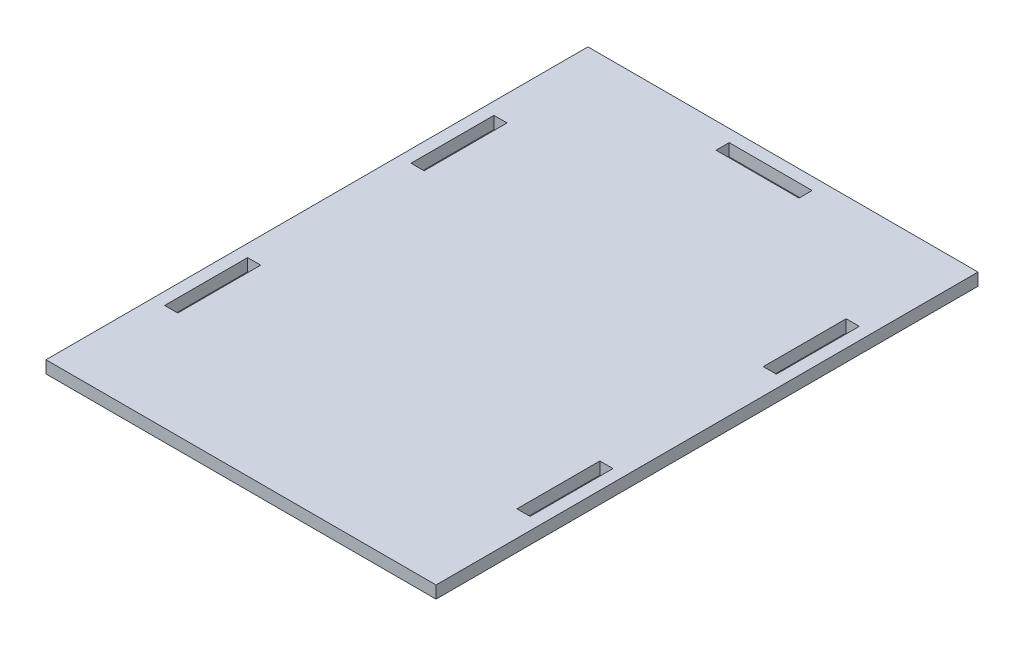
ISO-10303-21;
HEADER;
FILE_DESCRIPTION(('STEP AP214'),'2;1');
FILE_NAME('part.step','',(''),(''),'','','');
FILE_SCHEMA(('AUTOMOTIVE_DESIGN { 1 0 10303 214 1 1 1 1 }'));
ENDSEC;
DATA;
#1=APPLICATION_CONTEXT('core data for automotive mechanical design processes');
#2=APPLICATION_PROTOCOL_DEFINITION('international standard','automotive_design',2000,#1);
#3=PRODUCT_CONTEXT('',#1,'mechanical');
#4=PRODUCT('Part','Part','',(#3));
#5=PRODUCT_RELATED_PRODUCT_CATEGORY('part','',(#4));
#6=PRODUCT_DEFINITION_FORMATION('','',#4);
#7=PRODUCT_DEFINITION_CONTEXT('part definition',#1,'design');
#8=PRODUCT_DEFINITION('design','',#6,#7);
#9=PRODUCT_DEFINITION_SHAPE('','',#8);
#10=(LENGTH_UNIT() NAMED_UNIT(*) SI_UNIT(.MILLI.,.METRE.));
#11=(NAMED_UNIT(*) PLANE_ANGLE_UNIT() SI_UNIT($,.RADIAN.));
#12=(NAMED_UNIT(*) SI_UNIT($,.STERADIAN.) SOLID_ANGLE_UNIT());
#13=UNCERTAINTY_MEASURE_WITH_UNIT(LENGTH_MEASURE(1.E-05),#10,'distance_accuracy_value','');
#14=(GEOMETRIC_REPRESENTATION_CONTEXT(3) GLOBAL_UNCERTAINTY_ASSIGNED_CONTEXT((#13)) GLOBAL_UNIT_ASSIGNED_CONTEXT((#10,
#11,#12)) REPRESENTATION_CONTEXT('',''));
#15=CARTESIAN_POINT('',(0.,0.,0.));
#16=DIRECTION('',(0.,0.,1.));
#17=DIRECTION('',(1.,0.,0.));
#18=AXIS2_PLACEMENT_3D('',#15,#16,#17);
#19=CARTESIAN_POINT('',(0.,15.,0.));
#20=DIRECTION('',(0.,1.,0.));
#21=DIRECTION('',(0.,0.,1.));
#22=AXIS2_PLACEMENT_3D('',#19,#20,#21);
#23=PLANE('',#22);
#24=DIRECTION('',(0.,0.,1.));
#25=VECTOR('',#24,1.);
#26=CARTESIAN_POINT('',(-222.5,15.,99.4999999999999));
#27=LINE('',#26,#25);
#28=CARTESIAN_POINT('',(-222.5,15.,99.4999999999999));
#29=VERTEX_POINT('',#28);
#30=CARTESIAN_POINT('',(-222.5,15.,200.5));
#31=VERTEX_POINT('',#30);
#32=EDGE_CURVE('E50',#29,#31,#27,.T.);
#33=ORIENTED_EDGE('',*,*,#32,.F.);
#34=DIRECTION('',(-1.,0.,0.));
#35=VECTOR('',#34,1.);
#36=CARTESIAN_POINT('',(-222.5,15.,99.4999999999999));
#37=LINE('',#36,#35);
#38=CARTESIAN_POINT('',(-206.5,15.,99.4999999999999));
#39=VERTEX_POINT('',#38);
#40=EDGE_CURVE('E215',#39,#29,#37,.T.);
#41=ORIENTED_EDGE('',*,*,#40,.F.);
#42=DIRECTION('',(0.,0.,-1.));
#43=VECTOR('',#42,1.);
#44=CARTESIAN_POINT('',(-206.5,15.,99.4999999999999));
#45=LINE('',#44,#43);
#46=CARTESIAN_POINT('',(-206.5,15.,200.5));
#47=VERTEX_POINT('',#46);
#48=EDGE_CURVE('E218',#47,#39,#45,.T.);
#49=ORIENTED_EDGE('',*,*,#48,.F.);
#50=DIRECTION('',(1.,0.,0.));
#51=VECTOR('',#50,1.);
#52=CARTESIAN_POINT('',(-222.5,15.,200.5));
#53=LINE('',#52,#51);
#54=EDGE_CURVE('E224',#31,#47,#53,.T.);
#55=ORIENTED_EDGE('',*,*,#54,.F.);
#56=EDGE_LOOP('',(#33,#41,#49,#55));
#57=FACE_BOUND('',#56,.T.);
#58=DIRECTION('',(0.,0.,1.));
#59=VECTOR('',#58,1.);
#60=CARTESIAN_POINT('',(-50.5,15.,-315.));
#61=LINE('',#60,#59);
#62=CARTESIAN_POINT('',(-50.5,15.,-315.));
#63=VERTEX_POINT('',#62);
#64=CARTESIAN_POINT('',(-50.5,15.,-299.));
#65=VERTEX_POINT('',#64);
#66=EDGE_CURVE('E58',#63,#65,#61,.T.);
#67=ORIENTED_EDGE('',*,*,#66,.F.);
#68=DIRECTION('',(-1.,0.,0.));
#69=VECTOR('',#68,1.);
#70=CARTESIAN_POINT('',(-50.5,15.,-315.));
#71=LINE('',#70,#69);
#72=CARTESIAN_POINT('',(50.5,15.,-315.));
#73=VERTEX_POINT('',#72);
#74=EDGE_CURVE('E239',#73,#63,#71,.T.);
#75=ORIENTED_EDGE('',*,*,#74,.F.);
#76=DIRECTION('',(0.,0.,-1.));
#77=VECTOR('',#76,1.);
#78=CARTESIAN_POINT('',(50.5,15.,-315.));
#79=LINE('',#78,#77);
#80=CARTESIAN_POINT('',(50.5,15.,-299.));
#81=VERTEX_POINT('',#80);
#82=EDGE_CURVE('E254',#81,#73,#79,.T.);
#83=ORIENTED_EDGE('',*,*,#82,.F.);
#84=DIRECTION('',(1.,0.,0.));
#85=VECTOR('',#84,1.);
#86=CARTESIAN_POINT('',(-50.5,15.,-299.));
#87=LINE('',#86,#85);
#88=EDGE_CURVE('E250',#65,#81,#87,.T.);
#89=ORIENTED_EDGE('',*,*,#88,.F.);
#90=EDGE_LOOP('',(#67,#75,#83,#89));
#91=FACE_BOUND('',#90,.T.);
#92=DIRECTION('',(-1.,0.,0.));
#93=VECTOR('',#92,1.);
#94=CARTESIAN_POINT('',(222.5,15.,99.4999999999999));
#95=LINE('',#94,#93);
#96=CARTESIAN_POINT('',(222.5,15.,99.4999999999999));
#97=VERTEX_POINT('',#96);
#98=CARTESIAN_POINT('',(206.5,15.,99.4999999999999));
#99=VERTEX_POINT('',#98);
#100=EDGE_CURVE('E279',#97,#99,#95,.T.);
#101=ORIENTED_EDGE('',*,*,#100,.F.);
#102=DIRECTION('',(0.,0.,-1.));
#103=VECTOR('',#102,1.);
#104=CARTESIAN_POINT('',(222.5,15.,99.4999999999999));
#105=LINE('',#104,#103);
#106=CARTESIAN_POINT('',(222.5,15.,200.5));
#107=VERTEX_POINT('',#106);
#108=EDGE_CURVE('E269',#107,#97,#105,.T.);
#109=ORIENTED_EDGE('',*,*,#108,.F.);
#110=DIRECTION('',(1.,0.,0.));
#111=VECTOR('',#110,1.);
#112=CARTESIAN_POINT('',(222.5,15.,200.5));
#113=LINE('',#112,#111);
#114=CARTESIAN_POINT('',(206.5,15.,200.5));
#115=VERTEX_POINT('',#114);
#116=EDGE_CURVE('E285',#115,#107,#113,.T.);
#117=ORIENTED_EDGE('',*,*,#116,.F.);
#118=DIRECTION('',(0.,0.,1.));
#119=VECTOR('',#118,1.);
#120=CARTESIAN_POINT('',(206.5,15.,99.4999999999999));
#121=LINE('',#120,#119);
#122=EDGE_CURVE('E281',#99,#115,#121,.T.);
#123=ORIENTED_EDGE('',*,*,#122,.F.);
#124=EDGE_LOOP('',(#101,#109,#117,#123));
#125=FACE_BOUND('',#124,.T.);
#126=DIRECTION('',(-1.,0.,0.));
#127=VECTOR('',#126,1.);
#128=CARTESIAN_POINT('',(222.5,15.,-200.5));
#129=LINE('',#128,#127);
#130=CARTESIAN_POINT('',(222.5,15.,-200.5));
#131=VERTEX_POINT('',#130);
#132=CARTESIAN_POINT('',(206.5,15.,-200.5));
#133=VERTEX_POINT('',#132);
#134=EDGE_CURVE('E311',#131,#133,#129,.T.);
#135=ORIENTED_EDGE('',*,*,#134,.F.);
#136=DIRECTION('',(0.,0.,-1.));
#137=VECTOR('',#136,1.);
#138=CARTESIAN_POINT('',(222.5,15.,-200.5));
#139=LINE('',#138,#137);
#140=CARTESIAN_POINT('',(222.5,15.,-99.5));
#141=VERTEX_POINT('',#140);
#142=EDGE_CURVE('E301',#141,#131,#139,.T.);
#143=ORIENTED_EDGE('',*,*,#142,.F.);
#144=DIRECTION('',(1.,0.,0.));
#145=VECTOR('',#144,1.);
#146=CARTESIAN_POINT('',(222.5,15.,-99.5));
#147=LINE('',#146,#145);
#148=CARTESIAN_POINT('',(206.5,15.,-99.5));
#149=VERTEX_POINT('',#148);
#150=EDGE_CURVE('E316',#149,#141,#147,.T.);
#151=ORIENTED_EDGE('',*,*,#150,.F.);
#152=DIRECTION('',(0.,0.,1.));
#153=VECTOR('',#152,1.);
#154=CARTESIAN_POINT('',(206.5,15.,-200.5));
#155=LINE('',#154,#153);
#156=EDGE_CURVE('E313',#133,#149,#155,.T.);
#157=ORIENTED_EDGE('',*,*,#156,.F.);
#158=EDGE_LOOP('',(#135,#143,#151,#157));
#159=FACE_BOUND('',#158,.T.);
#160=DIRECTION('',(0.,0.,1.));
#161=VECTOR('',#160,1.);
#162=CARTESIAN_POINT('',(-222.5,15.,-200.5));
#163=LINE('',#162,#161);
#164=CARTESIAN_POINT('',(-222.5,15.,-200.5));
#165=VERTEX_POINT('',#164);
#166=CARTESIAN_POINT('',(-222.5,15.,-99.5));
#167=VERTEX_POINT('',#166);
#168=EDGE_CURVE('E231',#165,#167,#163,.T.);
#169=ORIENTED_EDGE('',*,*,#168,.F.);
#170=DIRECTION('',(-1.,0.,0.));
#171=VECTOR('',#170,1.);
#172=CARTESIAN_POINT('',(-222.5,15.,-200.5));
#173=LINE('',#172,#171);
#174=CARTESIAN_POINT('',(-206.5,15.,-200.5));
#175=VERTEX_POINT('',#174);
#176=EDGE_CURVE('E332',#175,#165,#173,.T.);
#177=ORIENTED_EDGE('',*,*,#176,.F.);
#178=DIRECTION('',(0.,0.,-1.));
#179=VECTOR('',#178,1.);
#180=CARTESIAN_POINT('',(-206.5,15.,-200.5));
#181=LINE('',#180,#179);
#182=CARTESIAN_POINT('',(-206.5,15.,-99.5));
#183=VERTEX_POINT('',#182);
#184=EDGE_CURVE('E346',#183,#175,#181,.T.);
#185=ORIENTED_EDGE('',*,*,#184,.F.);
#186=DIRECTION('',(1.,0.,0.));
#187=VECTOR('',#186,1.);
#188=CARTESIAN_POINT('',(-222.5,15.,-99.5));
#189=LINE('',#188,#187);
#190=EDGE_CURVE('E343',#167,#183,#189,.T.);
#191=ORIENTED_EDGE('',*,*,#190,.F.);
#192=EDGE_LOOP('',(#169,#177,#185,#191));
#193=FACE_BOUND('',#192,.T.);
#194=DIRECTION('',(0.,0.,-1.));
#195=VECTOR('',#194,1.);
#196=CARTESIAN_POINT('',(237.5,15.,-330.));
#197=LINE('',#196,#195);
#198=CARTESIAN_POINT('',(237.5,15.,330.));
#199=VERTEX_POINT('',#198);
#200=CARTESIAN_POINT('',(237.5,15.,-330.));
#201=VERTEX_POINT('',#200);
#202=EDGE_CURVE('E353',#199,#201,#197,.T.);
#203=ORIENTED_EDGE('',*,*,#202,.T.);
#204=DIRECTION('',(-1.,0.,0.));
#205=VECTOR('',#204,1.);
#206=CARTESIAN_POINT('',(-237.5,15.,-330.));
#207=LINE('',#206,#205);
#208=CARTESIAN_POINT('',(-237.5,15.,-330.));
#209=VERTEX_POINT('',#208);
#210=EDGE_CURVE('E375',#201,#209,#207,.T.);
#211=ORIENTED_EDGE('',*,*,#210,.T.);
#212=DIRECTION('',(0.,0.,1.));
#213=VECTOR('',#212,1.);
#214=CARTESIAN_POINT('',(-237.5,15.,-330.));
#215=LINE('',#214,#213);
#216=CARTESIAN_POINT('',(-237.5,15.,330.));
#217=VERTEX_POINT('',#216);
#218=EDGE_CURVE('E378',#209,#217,#215,.T.);
#219=ORIENTED_EDGE('',*,*,#218,.T.);
#220=DIRECTION('',(1.,0.,0.));
#221=VECTOR('',#220,1.);
#222=CARTESIAN_POINT('',(-237.5,15.,330.));
#223=LINE('',#222,#221);
#224=EDGE_CURVE('E364',#217,#199,#223,.T.);
#225=ORIENTED_EDGE('',*,*,#224,.T.);
#226=EDGE_LOOP('',(#203,#211,#219,#225));
#227=FACE_BOUND('',#226,.T.);
#228=ADVANCED_FACE('F33',(#57,#91,#125,#159,#193,#227),#23,.T.);
#229=CARTESIAN_POINT('',(237.5,0.,-330.));
#230=DIRECTION('',(1.,0.,0.));
#231=DIRECTION('',(0.,0.,-1.));
#232=AXIS2_PLACEMENT_3D('',#229,#230,#231);
#233=PLANE('',#232);
#234=ORIENTED_EDGE('',*,*,#202,.F.);
#235=DIRECTION('',(0.,1.,0.));
#236=VECTOR('',#235,1.);
#237=CARTESIAN_POINT('',(237.5,0.,330.));
#238=LINE('',#237,#236);
#239=CARTESIAN_POINT('',(237.5,0.,330.));
#240=VERTEX_POINT('',#239);
#241=EDGE_CURVE('E11',#240,#199,#238,.T.);
#242=ORIENTED_EDGE('',*,*,#241,.F.);
#243=DIRECTION('',(0.,0.,-1.));
#244=VECTOR('',#243,1.);
#245=CARTESIAN_POINT('',(237.5,0.,-330.));
#246=LINE('',#245,#244);
#247=CARTESIAN_POINT('',(237.5,0.,-330.));
#248=VERTEX_POINT('',#247);
#249=EDGE_CURVE('E360',#240,#248,#246,.T.);
#250=ORIENTED_EDGE('',*,*,#249,.T.);
#251=DIRECTION('',(0.,1.,0.));
#252=VECTOR('',#251,1.);
#253=CARTESIAN_POINT('',(237.5,0.,-330.));
#254=LINE('',#253,#252);
#255=EDGE_CURVE('E37',#248,#201,#254,.T.);
#256=ORIENTED_EDGE('',*,*,#255,.T.);
#257=EDGE_LOOP('',(#234,#242,#250,#256));
#258=FACE_BOUND('',#257,.T.);
#259=ADVANCED_FACE('F389',(#258),#233,.T.);
#260=CARTESIAN_POINT('',(-237.5,0.,330.));
#261=DIRECTION('',(0.,0.,1.));
#262=DIRECTION('',(1.,0.,0.));
#263=AXIS2_PLACEMENT_3D('',#260,#261,#262);
#264=PLANE('',#263);
#265=ORIENTED_EDGE('',*,*,#224,.F.);
#266=DIRECTION('',(0.,1.,0.));
#267=VECTOR('',#266,1.);
#268=CARTESIAN_POINT('',(-237.5,0.,330.));
#269=LINE('',#268,#267);
#270=CARTESIAN_POINT('',(-237.5,0.,330.));
#271=VERTEX_POINT('',#270);
#272=EDGE_CURVE('E42',#271,#217,#269,.T.);
#273=ORIENTED_EDGE('',*,*,#272,.F.);
#274=DIRECTION('',(1.,0.,0.));
#275=VECTOR('',#274,1.);
#276=CARTESIAN_POINT('',(-237.5,0.,330.));
#277=LINE('',#276,#275);
#278=EDGE_CURVE('E370',#271,#240,#277,.T.);
#279=ORIENTED_EDGE('',*,*,#278,.T.);
#280=ORIENTED_EDGE('',*,*,#241,.T.);
#281=EDGE_LOOP('',(#265,#273,#279,#280));
#282=FACE_BOUND('',#281,.T.);
#283=ADVANCED_FACE('F396',(#282),#264,.T.);
#284=CARTESIAN_POINT('',(-237.5,0.,-330.));
#285=DIRECTION('',(-1.,0.,0.));
#286=DIRECTION('',(0.,0.,1.));
#287=AXIS2_PLACEMENT_3D('',#284,#285,#286);
#288=PLANE('',#287);
#289=ORIENTED_EDGE('',*,*,#218,.F.);
#290=DIRECTION('',(0.,1.,0.));
#291=VECTOR('',#290,1.);
#292=CARTESIAN_POINT('',(-237.5,0.,-330.));
#293=LINE('',#292,#291);
#294=CARTESIAN_POINT('',(-237.5,0.,-330.));
#295=VERTEX_POINT('',#294);
#296=EDGE_CURVE('E383',#295,#209,#293,.T.);
#297=ORIENTED_EDGE('',*,*,#296,.F.);
#298=DIRECTION('',(0.,0.,1.));
#299=VECTOR('',#298,1.);
#300=CARTESIAN_POINT('',(-237.5,0.,-330.));
#301=LINE('',#300,#299);
#302=EDGE_CURVE('E367',#295,#271,#301,.T.);
#303=ORIENTED_EDGE('',*,*,#302,.T.);
#304=ORIENTED_EDGE('',*,*,#272,.T.);
#305=EDGE_LOOP('',(#289,#297,#303,#304));
#306=FACE_BOUND('',#305,.T.);
#307=ADVANCED_FACE('F401',(#306),#288,.T.);
#308=CARTESIAN_POINT('',(-237.5,0.,-330.));
#309=DIRECTION('',(0.,0.,-1.));
#310=DIRECTION('',(-1.,0.,0.));
#311=AXIS2_PLACEMENT_3D('',#308,#309,#310);
#312=PLANE('',#311);
#313=ORIENTED_EDGE('',*,*,#210,.F.);
#314=ORIENTED_EDGE('',*,*,#255,.F.);
#315=DIRECTION('',(-1.,0.,0.));
#316=VECTOR('',#315,1.);
#317=CARTESIAN_POINT('',(-237.5,0.,-330.));
#318=LINE('',#317,#316);
#319=EDGE_CURVE('E363',#248,#295,#318,.T.);
#320=ORIENTED_EDGE('',*,*,#319,.T.);
#321=ORIENTED_EDGE('',*,*,#296,.T.);
#322=EDGE_LOOP('',(#313,#314,#320,#321));
#323=FACE_BOUND('',#322,.T.);
#324=ADVANCED_FACE('F392',(#323),#312,.T.);
#325=CARTESIAN_POINT('',(0.,0.,0.));
#326=DIRECTION('',(0.,1.,0.));
#327=DIRECTION('',(0.,0.,1.));
#328=AXIS2_PLACEMENT_3D('',#325,#326,#327);
#329=PLANE('',#328);
#330=DIRECTION('',(-1.,0.,0.));
#331=VECTOR('',#330,1.);
#332=CARTESIAN_POINT('',(-222.5,0.,99.4999999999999));
#333=LINE('',#332,#331);
#334=CARTESIAN_POINT('',(-206.5,0.,99.4999999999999));
#335=VERTEX_POINT('',#334);
#336=CARTESIAN_POINT('',(-222.5,0.,99.4999999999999));
#337=VERTEX_POINT('',#336);
#338=EDGE_CURVE('E203',#335,#337,#333,.T.);
#339=ORIENTED_EDGE('',*,*,#338,.T.);
#340=DIRECTION('',(0.,0.,1.));
#341=VECTOR('',#340,1.);
#342=CARTESIAN_POINT('',(-222.5,0.,99.4999999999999));
#343=LINE('',#342,#341);
#344=CARTESIAN_POINT('',(-222.5,0.,200.5));
#345=VERTEX_POINT('',#344);
#346=EDGE_CURVE('E197',#337,#345,#343,.T.);
#347=ORIENTED_EDGE('',*,*,#346,.T.);
#348=DIRECTION('',(1.,0.,0.));
#349=VECTOR('',#348,1.);
#350=CARTESIAN_POINT('',(-222.5,0.,200.5));
#351=LINE('',#350,#349);
#352=CARTESIAN_POINT('',(-206.5,0.,200.5));
#353=VERTEX_POINT('',#352);
#354=EDGE_CURVE('E207',#345,#353,#351,.T.);
#355=ORIENTED_EDGE('',*,*,#354,.T.);
#356=DIRECTION('',(0.,0.,-1.));
#357=VECTOR('',#356,1.);
#358=CARTESIAN_POINT('',(-206.5,0.,99.4999999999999));
#359=LINE('',#358,#357);
#360=EDGE_CURVE('E211',#353,#335,#359,.T.);
#361=ORIENTED_EDGE('',*,*,#360,.T.);
#362=EDGE_LOOP('',(#339,#347,#355,#361));
#363=FACE_BOUND('',#362,.T.);
#364=DIRECTION('',(-1.,0.,0.));
#365=VECTOR('',#364,1.);
#366=CARTESIAN_POINT('',(-50.5,0.,-315.));
#367=LINE('',#366,#365);
#368=CARTESIAN_POINT('',(50.5,0.,-315.));
#369=VERTEX_POINT('',#368);
#370=CARTESIAN_POINT('',(-50.5,0.,-315.));
#371=VERTEX_POINT('',#370);
#372=EDGE_CURVE('E245',#369,#371,#367,.T.);
#373=ORIENTED_EDGE('',*,*,#372,.T.);
#374=DIRECTION('',(0.,0.,1.));
#375=VECTOR('',#374,1.);
#376=CARTESIAN_POINT('',(-50.5,0.,-315.));
#377=LINE('',#376,#375);
#378=CARTESIAN_POINT('',(-50.5,0.,-299.));
#379=VERTEX_POINT('',#378);
#380=EDGE_CURVE('E235',#371,#379,#377,.T.);
#381=ORIENTED_EDGE('',*,*,#380,.T.);
#382=DIRECTION('',(1.,0.,0.));
#383=VECTOR('',#382,1.);
#384=CARTESIAN_POINT('',(-50.5,0.,-299.));
#385=LINE('',#384,#383);
#386=CARTESIAN_POINT('',(50.5,0.,-299.));
#387=VERTEX_POINT('',#386);
#388=EDGE_CURVE('E238',#379,#387,#385,.T.);
#389=ORIENTED_EDGE('',*,*,#388,.T.);
#390=DIRECTION('',(0.,0.,-1.));
#391=VECTOR('',#390,1.);
#392=CARTESIAN_POINT('',(50.5,0.,-315.));
#393=LINE('',#392,#391);
#394=EDGE_CURVE('E242',#387,#369,#393,.T.);
#395=ORIENTED_EDGE('',*,*,#394,.T.);
#396=EDGE_LOOP('',(#373,#381,#389,#395));
#397=FACE_BOUND('',#396,.T.);
#398=DIRECTION('',(0.,0.,-1.));
#399=VECTOR('',#398,1.);
#400=CARTESIAN_POINT('',(222.5,0.,99.4999999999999));
#401=LINE('',#400,#399);
#402=CARTESIAN_POINT('',(222.5,0.,200.5));
#403=VERTEX_POINT('',#402);
#404=CARTESIAN_POINT('',(222.5,0.,99.4999999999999));
#405=VERTEX_POINT('',#404);
#406=EDGE_CURVE('E275',#403,#405,#401,.T.);
#407=ORIENTED_EDGE('',*,*,#406,.T.);
#408=DIRECTION('',(-1.,0.,0.));
#409=VECTOR('',#408,1.);
#410=CARTESIAN_POINT('',(222.5,0.,99.4999999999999));
#411=LINE('',#410,#409);
#412=CARTESIAN_POINT('',(206.5,0.,99.4999999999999));
#413=VERTEX_POINT('',#412);
#414=EDGE_CURVE('E265',#405,#413,#411,.T.);
#415=ORIENTED_EDGE('',*,*,#414,.T.);
#416=DIRECTION('',(0.,0.,1.));
#417=VECTOR('',#416,1.);
#418=CARTESIAN_POINT('',(206.5,0.,99.4999999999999));
#419=LINE('',#418,#417);
#420=CARTESIAN_POINT('',(206.5,0.,200.5));
#421=VERTEX_POINT('',#420);
#422=EDGE_CURVE('E268',#413,#421,#419,.T.);
#423=ORIENTED_EDGE('',*,*,#422,.T.);
#424=DIRECTION('',(1.,0.,0.));
#425=VECTOR('',#424,1.);
#426=CARTESIAN_POINT('',(222.5,0.,200.5));
#427=LINE('',#426,#425);
#428=EDGE_CURVE('E272',#421,#403,#427,.T.);
#429=ORIENTED_EDGE('',*,*,#428,.T.);
#430=EDGE_LOOP('',(#407,#415,#423,#429));
#431=FACE_BOUND('',#430,.T.);
#432=DIRECTION('',(0.,0.,-1.));
#433=VECTOR('',#432,1.);
#434=CARTESIAN_POINT('',(222.5,0.,-200.5));
#435=LINE('',#434,#433);
#436=CARTESIAN_POINT('',(222.5,0.,-99.5));
#437=VERTEX_POINT('',#436);
#438=CARTESIAN_POINT('',(222.5,0.,-200.5));
#439=VERTEX_POINT('',#438);
#440=EDGE_CURVE('E307',#437,#439,#435,.T.);
#441=ORIENTED_EDGE('',*,*,#440,.T.);
#442=DIRECTION('',(-1.,0.,0.));
#443=VECTOR('',#442,1.);
#444=CARTESIAN_POINT('',(222.5,0.,-200.5));
#445=LINE('',#444,#443);
#446=CARTESIAN_POINT('',(206.5,0.,-200.5));
#447=VERTEX_POINT('',#446);
#448=EDGE_CURVE('E297',#439,#447,#445,.T.);
#449=ORIENTED_EDGE('',*,*,#448,.T.);
#450=DIRECTION('',(0.,0.,1.));
#451=VECTOR('',#450,1.);
#452=CARTESIAN_POINT('',(206.5,0.,-200.5));
#453=LINE('',#452,#451);
#454=CARTESIAN_POINT('',(206.5,0.,-99.5));
#455=VERTEX_POINT('',#454);
#456=EDGE_CURVE('E300',#447,#455,#453,.T.);
#457=ORIENTED_EDGE('',*,*,#456,.T.);
#458=DIRECTION('',(1.,0.,0.));
#459=VECTOR('',#458,1.);
#460=CARTESIAN_POINT('',(222.5,0.,-99.5));
#461=LINE('',#460,#459);
#462=EDGE_CURVE('E304',#455,#437,#461,.T.);
#463=ORIENTED_EDGE('',*,*,#462,.T.);
#464=EDGE_LOOP('',(#441,#449,#457,#463));
#465=FACE_BOUND('',#464,.T.);
#466=DIRECTION('',(-1.,0.,0.));
#467=VECTOR('',#466,1.);
#468=CARTESIAN_POINT('',(-222.5,0.,-200.5));
#469=LINE('',#468,#467);
#470=CARTESIAN_POINT('',(-206.5,0.,-200.5));
#471=VERTEX_POINT('',#470);
#472=CARTESIAN_POINT('',(-222.5,0.,-200.5));
#473=VERTEX_POINT('',#472);
#474=EDGE_CURVE('E338',#471,#473,#469,.T.);
#475=ORIENTED_EDGE('',*,*,#474,.T.);
#476=DIRECTION('',(0.,0.,1.));
#477=VECTOR('',#476,1.);
#478=CARTESIAN_POINT('',(-222.5,0.,-200.5));
#479=LINE('',#478,#477);
#480=CARTESIAN_POINT('',(-222.5,0.,-99.5));
#481=VERTEX_POINT('',#480);
#482=EDGE_CURVE('E328',#473,#481,#479,.T.);
#483=ORIENTED_EDGE('',*,*,#482,.T.);
#484=DIRECTION('',(1.,0.,0.));
#485=VECTOR('',#484,1.);
#486=CARTESIAN_POINT('',(-222.5,0.,-99.5));
#487=LINE('',#486,#485);
#488=CARTESIAN_POINT('',(-206.5,0.,-99.5));
#489=VERTEX_POINT('',#488);
#490=EDGE_CURVE('E331',#481,#489,#487,.T.);
#491=ORIENTED_EDGE('',*,*,#490,.T.);
#492=DIRECTION('',(0.,0.,-1.));
#493=VECTOR('',#492,1.);
#494=CARTESIAN_POINT('',(-206.5,0.,-200.5));
#495=LINE('',#494,#493);
#496=EDGE_CURVE('E335',#489,#471,#495,.T.);
#497=ORIENTED_EDGE('',*,*,#496,.T.);
#498=EDGE_LOOP('',(#475,#483,#491,#497));
#499=FACE_BOUND('',#498,.T.);
#500=ORIENTED_EDGE('',*,*,#249,.F.);
#501=ORIENTED_EDGE('',*,*,#278,.F.);
#502=ORIENTED_EDGE('',*,*,#302,.F.);
#503=ORIENTED_EDGE('',*,*,#319,.F.);
#504=EDGE_LOOP('',(#500,#501,#502,#503));
#505=FACE_BOUND('',#504,.T.);
#506=ADVANCED_FACE('F35',(#363,#397,#431,#465,#499,#505),#329,.F.);
#507=CARTESIAN_POINT('',(-222.5,0.,-200.5));
#508=DIRECTION('',(-1.,0.,0.));
#509=DIRECTION('',(0.,0.,1.));
#510=AXIS2_PLACEMENT_3D('',#507,#508,#509);
#511=PLANE('',#510);
#512=ORIENTED_EDGE('',*,*,#168,.T.);
#513=DIRECTION('',(0.,1.,0.));
#514=VECTOR('',#513,1.);
#515=CARTESIAN_POINT('',(-222.5,0.,-99.5));
#516=LINE('',#515,#514);
#517=EDGE_CURVE('E341',#481,#167,#516,.T.);
#518=ORIENTED_EDGE('',*,*,#517,.F.);
#519=ORIENTED_EDGE('',*,*,#482,.F.);
#520=DIRECTION('',(0.,1.,0.));
#521=VECTOR('',#520,1.);
#522=CARTESIAN_POINT('',(-222.5,0.,-200.5));
#523=LINE('',#522,#521);
#524=EDGE_CURVE('E351',#473,#165,#523,.T.);
#525=ORIENTED_EDGE('',*,*,#524,.T.);
#526=EDGE_LOOP('',(#512,#518,#519,#525));
#527=FACE_BOUND('',#526,.T.);
#528=ADVANCED_FACE('F434',(#527),#511,.F.);
#529=CARTESIAN_POINT('',(-222.5,0.,-200.5));
#530=DIRECTION('',(0.,0.,-1.));
#531=DIRECTION('',(-1.,0.,0.));
#532=AXIS2_PLACEMENT_3D('',#529,#530,#531);
#533=PLANE('',#532);
#534=ORIENTED_EDGE('',*,*,#176,.T.);
#535=ORIENTED_EDGE('',*,*,#524,.F.);
#536=ORIENTED_EDGE('',*,*,#474,.F.);
#537=DIRECTION('',(0.,1.,0.));
#538=VECTOR('',#537,1.);
#539=CARTESIAN_POINT('',(-206.5,0.,-200.5));
#540=LINE('',#539,#538);
#541=EDGE_CURVE('E354',#471,#175,#540,.T.);
#542=ORIENTED_EDGE('',*,*,#541,.T.);
#543=EDGE_LOOP('',(#534,#535,#536,#542));
#544=FACE_BOUND('',#543,.T.);
#545=ADVANCED_FACE('F443',(#544),#533,.F.);
#546=CARTESIAN_POINT('',(-206.5,0.,-200.5));
#547=DIRECTION('',(1.,0.,0.));
#548=DIRECTION('',(0.,0.,-1.));
#549=AXIS2_PLACEMENT_3D('',#546,#547,#548);
#550=PLANE('',#549);
#551=ORIENTED_EDGE('',*,*,#184,.T.);
#552=ORIENTED_EDGE('',*,*,#541,.F.);
#553=ORIENTED_EDGE('',*,*,#496,.F.);
#554=DIRECTION('',(0.,1.,0.));
#555=VECTOR('',#554,1.);
#556=CARTESIAN_POINT('',(-206.5,0.,-99.5));
#557=LINE('',#556,#555);
#558=EDGE_CURVE('E356',#489,#183,#557,.T.);
#559=ORIENTED_EDGE('',*,*,#558,.T.);
#560=EDGE_LOOP('',(#551,#552,#553,#559));
#561=FACE_BOUND('',#560,.T.);
#562=ADVANCED_FACE('F445',(#561),#550,.F.);
#563=CARTESIAN_POINT('',(-222.5,0.,-99.5));
#564=DIRECTION('',(0.,0.,1.));
#565=DIRECTION('',(1.,0.,0.));
#566=AXIS2_PLACEMENT_3D('',#563,#564,#565);
#567=PLANE('',#566);
#568=ORIENTED_EDGE('',*,*,#190,.T.);
#569=ORIENTED_EDGE('',*,*,#558,.F.);
#570=ORIENTED_EDGE('',*,*,#490,.F.);
#571=ORIENTED_EDGE('',*,*,#517,.T.);
#572=EDGE_LOOP('',(#568,#569,#570,#571));
#573=FACE_BOUND('',#572,.T.);
#574=ADVANCED_FACE('F438',(#573),#567,.F.);
#575=CARTESIAN_POINT('',(222.5,0.,-200.5));
#576=DIRECTION('',(0.,0.,-1.));
#577=DIRECTION('',(-1.,0.,0.));
#578=AXIS2_PLACEMENT_3D('',#575,#576,#577);
#579=PLANE('',#578);
#580=ORIENTED_EDGE('',*,*,#134,.T.);
#581=DIRECTION('',(0.,1.,0.));
#582=VECTOR('',#581,1.);
#583=CARTESIAN_POINT('',(206.5,0.,-200.5));
#584=LINE('',#583,#582);
#585=EDGE_CURVE('E310',#447,#133,#584,.T.);
#586=ORIENTED_EDGE('',*,*,#585,.F.);
#587=ORIENTED_EDGE('',*,*,#448,.F.);
#588=DIRECTION('',(0.,1.,0.));
#589=VECTOR('',#588,1.);
#590=CARTESIAN_POINT('',(222.5,0.,-200.5));
#591=LINE('',#590,#589);
#592=EDGE_CURVE('E282',#439,#131,#591,.T.);
#593=ORIENTED_EDGE('',*,*,#592,.T.);
#594=EDGE_LOOP('',(#580,#586,#587,#593));
#595=FACE_BOUND('',#594,.T.);
#596=ADVANCED_FACE('F452',(#595),#579,.F.);
#597=CARTESIAN_POINT('',(222.5,0.,-200.5));
#598=DIRECTION('',(1.,0.,0.));
#599=DIRECTION('',(0.,0.,-1.));
#600=AXIS2_PLACEMENT_3D('',#597,#598,#599);
#601=PLANE('',#600);
#602=ORIENTED_EDGE('',*,*,#142,.T.);
#603=ORIENTED_EDGE('',*,*,#592,.F.);
#604=ORIENTED_EDGE('',*,*,#440,.F.);
#605=DIRECTION('',(0.,1.,0.));
#606=VECTOR('',#605,1.);
#607=CARTESIAN_POINT('',(222.5,0.,-99.5));
#608=LINE('',#607,#606);
#609=EDGE_CURVE('E322',#437,#141,#608,.T.);
#610=ORIENTED_EDGE('',*,*,#609,.T.);
#611=EDGE_LOOP('',(#602,#603,#604,#610));
#612=FACE_BOUND('',#611,.T.);
#613=ADVANCED_FACE('F523',(#612),#601,.F.);
#614=CARTESIAN_POINT('',(222.5,0.,-99.5));
#615=DIRECTION('',(0.,0.,1.));
#616=DIRECTION('',(1.,0.,0.));
#617=AXIS2_PLACEMENT_3D('',#614,#615,#616);
#618=PLANE('',#617);
#619=ORIENTED_EDGE('',*,*,#150,.T.);
#620=ORIENTED_EDGE('',*,*,#609,.F.);
#621=ORIENTED_EDGE('',*,*,#462,.F.);
#622=DIRECTION('',(0.,1.,0.));
#623=VECTOR('',#622,1.);
#624=CARTESIAN_POINT('',(206.5,0.,-99.5));
#625=LINE('',#624,#623);
#626=EDGE_CURVE('E324',#455,#149,#625,.T.);
#627=ORIENTED_EDGE('',*,*,#626,.T.);
#628=EDGE_LOOP('',(#619,#620,#621,#627));
#629=FACE_BOUND('',#628,.T.);
#630=ADVANCED_FACE('F531',(#629),#618,.F.);
#631=CARTESIAN_POINT('',(206.5,0.,-200.5));
#632=DIRECTION('',(-1.,0.,0.));
#633=DIRECTION('',(0.,0.,1.));
#634=AXIS2_PLACEMENT_3D('',#631,#632,#633);
#635=PLANE('',#634);
#636=ORIENTED_EDGE('',*,*,#156,.T.);
#637=ORIENTED_EDGE('',*,*,#626,.F.);
#638=ORIENTED_EDGE('',*,*,#456,.F.);
#639=ORIENTED_EDGE('',*,*,#585,.T.);
#640=EDGE_LOOP('',(#636,#637,#638,#639));
#641=FACE_BOUND('',#640,.T.);
#642=ADVANCED_FACE('F540',(#641),#635,.F.);
#643=CARTESIAN_POINT('',(222.5,0.,99.4999999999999));
#644=DIRECTION('',(0.,0.,-1.));
#645=DIRECTION('',(-1.,0.,0.));
#646=AXIS2_PLACEMENT_3D('',#643,#644,#645);
#647=PLANE('',#646);
#648=ORIENTED_EDGE('',*,*,#100,.T.);
#649=DIRECTION('',(0.,1.,0.));
#650=VECTOR('',#649,1.);
#651=CARTESIAN_POINT('',(206.5,0.,99.4999999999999));
#652=LINE('',#651,#650);
#653=EDGE_CURVE('E278',#413,#99,#652,.T.);
#654=ORIENTED_EDGE('',*,*,#653,.F.);
#655=ORIENTED_EDGE('',*,*,#414,.F.);
#656=DIRECTION('',(0.,1.,0.));
#657=VECTOR('',#656,1.);
#658=CARTESIAN_POINT('',(222.5,0.,99.4999999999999));
#659=LINE('',#658,#657);
#660=EDGE_CURVE('E251',#405,#97,#659,.T.);
#661=ORIENTED_EDGE('',*,*,#660,.T.);
#662=EDGE_LOOP('',(#648,#654,#655,#661));
#663=FACE_BOUND('',#662,.T.);
#664=ADVANCED_FACE('F549',(#663),#647,.F.);
#665=CARTESIAN_POINT('',(222.5,0.,99.4999999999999));
#666=DIRECTION('',(1.,0.,0.));
#667=DIRECTION('',(0.,0.,-1.));
#668=AXIS2_PLACEMENT_3D('',#665,#666,#667);
#669=PLANE('',#668);
#670=ORIENTED_EDGE('',*,*,#108,.T.);
#671=ORIENTED_EDGE('',*,*,#660,.F.);
#672=ORIENTED_EDGE('',*,*,#406,.F.);
#673=DIRECTION('',(0.,1.,0.));
#674=VECTOR('',#673,1.);
#675=CARTESIAN_POINT('',(222.5,0.,200.5));
#676=LINE('',#675,#674);
#677=EDGE_CURVE('E291',#403,#107,#676,.T.);
#678=ORIENTED_EDGE('',*,*,#677,.T.);
#679=EDGE_LOOP('',(#670,#671,#672,#678));
#680=FACE_BOUND('',#679,.T.);
#681=ADVANCED_FACE('F558',(#680),#669,.F.);
#682=CARTESIAN_POINT('',(222.5,0.,200.5));
#683=DIRECTION('',(0.,0.,1.));
#684=DIRECTION('',(1.,0.,0.));
#685=AXIS2_PLACEMENT_3D('',#682,#683,#684);
#686=PLANE('',#685);
#687=ORIENTED_EDGE('',*,*,#116,.T.);
#688=ORIENTED_EDGE('',*,*,#677,.F.);
#689=ORIENTED_EDGE('',*,*,#428,.F.);
#690=DIRECTION('',(0.,1.,0.));
#691=VECTOR('',#690,1.);
#692=CARTESIAN_POINT('',(206.5,0.,200.5));
#693=LINE('',#692,#691);
#694=EDGE_CURVE('E293',#421,#115,#693,.T.);
#695=ORIENTED_EDGE('',*,*,#694,.T.);
#696=EDGE_LOOP('',(#687,#688,#689,#695));
#697=FACE_BOUND('',#696,.T.);
#698=ADVANCED_FACE('F567',(#697),#686,.F.);
#699=CARTESIAN_POINT('',(206.5,0.,99.4999999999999));
#700=DIRECTION('',(-1.,0.,0.));
#701=DIRECTION('',(0.,0.,1.));
#702=AXIS2_PLACEMENT_3D('',#699,#700,#701);
#703=PLANE('',#702);
#704=ORIENTED_EDGE('',*,*,#122,.T.);
#705=ORIENTED_EDGE('',*,*,#694,.F.);
#706=ORIENTED_EDGE('',*,*,#422,.F.);
#707=ORIENTED_EDGE('',*,*,#653,.T.);
#708=EDGE_LOOP('',(#704,#705,#706,#707));
#709=FACE_BOUND('',#708,.T.);
#710=ADVANCED_FACE('F576',(#709),#703,.F.);
#711=CARTESIAN_POINT('',(-50.5,0.,-315.));
#712=DIRECTION('',(-1.,0.,0.));
#713=DIRECTION('',(0.,0.,1.));
#714=AXIS2_PLACEMENT_3D('',#711,#712,#713);
#715=PLANE('',#714);
#716=ORIENTED_EDGE('',*,*,#66,.T.);
#717=DIRECTION('',(0.,1.,0.));
#718=VECTOR('',#717,1.);
#719=CARTESIAN_POINT('',(-50.5,0.,-299.));
#720=LINE('',#719,#718);
#721=EDGE_CURVE('E248',#379,#65,#720,.T.);
#722=ORIENTED_EDGE('',*,*,#721,.F.);
#723=ORIENTED_EDGE('',*,*,#380,.F.);
#724=DIRECTION('',(0.,1.,0.));
#725=VECTOR('',#724,1.);
#726=CARTESIAN_POINT('',(-50.5,0.,-315.));
#727=LINE('',#726,#725);
#728=EDGE_CURVE('E225',#371,#63,#727,.T.);
#729=ORIENTED_EDGE('',*,*,#728,.T.);
#730=EDGE_LOOP('',(#716,#722,#723,#729));
#731=FACE_BOUND('',#730,.T.);
#732=ADVANCED_FACE('F585',(#731),#715,.F.);
#733=CARTESIAN_POINT('',(-50.5,0.,-315.));
#734=DIRECTION('',(0.,0.,-1.));
#735=DIRECTION('',(-1.,0.,0.));
#736=AXIS2_PLACEMENT_3D('',#733,#734,#735);
#737=PLANE('',#736);
#738=ORIENTED_EDGE('',*,*,#74,.T.);
#739=ORIENTED_EDGE('',*,*,#728,.F.);
#740=ORIENTED_EDGE('',*,*,#372,.F.);
#741=DIRECTION('',(0.,1.,0.));
#742=VECTOR('',#741,1.);
#743=CARTESIAN_POINT('',(50.5,0.,-315.));
#744=LINE('',#743,#742);
#745=EDGE_CURVE('E260',#369,#73,#744,.T.);
#746=ORIENTED_EDGE('',*,*,#745,.T.);
#747=EDGE_LOOP('',(#738,#739,#740,#746));
#748=FACE_BOUND('',#747,.T.);
#749=ADVANCED_FACE('F594',(#748),#737,.F.);
#750=CARTESIAN_POINT('',(50.5,0.,-315.));
#751=DIRECTION('',(1.,0.,0.));
#752=DIRECTION('',(0.,0.,-1.));
#753=AXIS2_PLACEMENT_3D('',#750,#751,#752);
#754=PLANE('',#753);
#755=ORIENTED_EDGE('',*,*,#82,.T.);
#756=ORIENTED_EDGE('',*,*,#745,.F.);
#757=ORIENTED_EDGE('',*,*,#394,.F.);
#758=DIRECTION('',(0.,1.,0.));
#759=VECTOR('',#758,1.);
#760=CARTESIAN_POINT('',(50.5,0.,-299.));
#761=LINE('',#760,#759);
#762=EDGE_CURVE('E262',#387,#81,#761,.T.);
#763=ORIENTED_EDGE('',*,*,#762,.T.);
#764=EDGE_LOOP('',(#755,#756,#757,#763));
#765=FACE_BOUND('',#764,.T.);
#766=ADVANCED_FACE('F602',(#765),#754,.F.);
#767=CARTESIAN_POINT('',(-50.5,0.,-299.));
#768=DIRECTION('',(0.,0.,1.));
#769=DIRECTION('',(1.,0.,0.));
#770=AXIS2_PLACEMENT_3D('',#767,#768,#769);
#771=PLANE('',#770);
#772=ORIENTED_EDGE('',*,*,#88,.T.);
#773=ORIENTED_EDGE('',*,*,#762,.F.);
#774=ORIENTED_EDGE('',*,*,#388,.F.);
#775=ORIENTED_EDGE('',*,*,#721,.T.);
#776=EDGE_LOOP('',(#772,#773,#774,#775));
#777=FACE_BOUND('',#776,.T.);
#778=ADVANCED_FACE('F611',(#777),#771,.F.);
#779=CARTESIAN_POINT('',(-222.5,0.,99.4999999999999));
#780=DIRECTION('',(-1.,0.,0.));
#781=DIRECTION('',(0.,0.,1.));
#782=AXIS2_PLACEMENT_3D('',#779,#780,#781);
#783=PLANE('',#782);
#784=ORIENTED_EDGE('',*,*,#32,.T.);
#785=DIRECTION('',(0.,1.,0.));
#786=VECTOR('',#785,1.);
#787=CARTESIAN_POINT('',(-222.5,0.,200.5));
#788=LINE('',#787,#786);
#789=EDGE_CURVE('E193',#345,#31,#788,.T.);
#790=ORIENTED_EDGE('',*,*,#789,.F.);
#791=ORIENTED_EDGE('',*,*,#346,.F.);
#792=DIRECTION('',(0.,1.,0.));
#793=VECTOR('',#792,1.);
#794=CARTESIAN_POINT('',(-222.5,0.,99.4999999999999));
#795=LINE('',#794,#793);
#796=EDGE_CURVE('E229',#337,#29,#795,.T.);
#797=ORIENTED_EDGE('',*,*,#796,.T.);
#798=EDGE_LOOP('',(#784,#790,#791,#797));
#799=FACE_BOUND('',#798,.T.);
#800=ADVANCED_FACE('F195',(#799),#783,.F.);
#801=CARTESIAN_POINT('',(-222.5,0.,99.4999999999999));
#802=DIRECTION('',(0.,0.,-1.));
#803=DIRECTION('',(-1.,0.,0.));
#804=AXIS2_PLACEMENT_3D('',#801,#802,#803);
#805=PLANE('',#804);
#806=ORIENTED_EDGE('',*,*,#40,.T.);
#807=ORIENTED_EDGE('',*,*,#796,.F.);
#808=ORIENTED_EDGE('',*,*,#338,.F.);
#809=DIRECTION('',(0.,1.,0.));
#810=VECTOR('',#809,1.);
#811=CARTESIAN_POINT('',(-206.5,0.,99.4999999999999));
#812=LINE('',#811,#810);
#813=EDGE_CURVE('E232',#335,#39,#812,.T.);
#814=ORIENTED_EDGE('',*,*,#813,.T.);
#815=EDGE_LOOP('',(#806,#807,#808,#814));
#816=FACE_BOUND('',#815,.T.);
#817=ADVANCED_FACE('F628',(#816),#805,.F.);
#818=CARTESIAN_POINT('',(-206.5,0.,99.4999999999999));
#819=DIRECTION('',(1.,0.,0.));
#820=DIRECTION('',(0.,0.,-1.));
#821=AXIS2_PLACEMENT_3D('',#818,#819,#820);
#822=PLANE('',#821);
#823=ORIENTED_EDGE('',*,*,#48,.T.);
#824=ORIENTED_EDGE('',*,*,#813,.F.);
#825=ORIENTED_EDGE('',*,*,#360,.F.);
#826=DIRECTION('',(0.,1.,0.));
#827=VECTOR('',#826,1.);
#828=CARTESIAN_POINT('',(-206.5,0.,200.5));
#829=LINE('',#828,#827);
#830=EDGE_CURVE('E202',#353,#47,#829,.T.);
#831=ORIENTED_EDGE('',*,*,#830,.T.);
#832=EDGE_LOOP('',(#823,#824,#825,#831));
#833=FACE_BOUND('',#832,.T.);
#834=ADVANCED_FACE('F636',(#833),#822,.F.);
#835=CARTESIAN_POINT('',(-222.5,0.,200.5));
#836=DIRECTION('',(0.,0.,1.));
#837=DIRECTION('',(1.,0.,0.));
#838=AXIS2_PLACEMENT_3D('',#835,#836,#837);
#839=PLANE('',#838);
#840=ORIENTED_EDGE('',*,*,#54,.T.);
#841=ORIENTED_EDGE('',*,*,#830,.F.);
#842=ORIENTED_EDGE('',*,*,#354,.F.);
#843=ORIENTED_EDGE('',*,*,#789,.T.);
#844=EDGE_LOOP('',(#840,#841,#842,#843));
#845=FACE_BOUND('',#844,.T.);
#846=ADVANCED_FACE('F208',(#845),#839,.F.);
#847=CLOSED_SHELL('',(#228,#259,#283,#307,#324,#506,#528,#545,#562,#574,#596,#613,#630,#642,
#664,#681,#698,#710,#732,#749,#766,#778,#800,#817,#834,#846));
#848=MANIFOLD_SOLID_BREP('B2',#847);
#849=ADVANCED_BREP_SHAPE_REPRESENTATION('',(#18,#848),#14);
#850=SHAPE_DEFINITION_REPRESENTATION(#9,#849);
ENDSEC;
END-ISO-10303-21;
